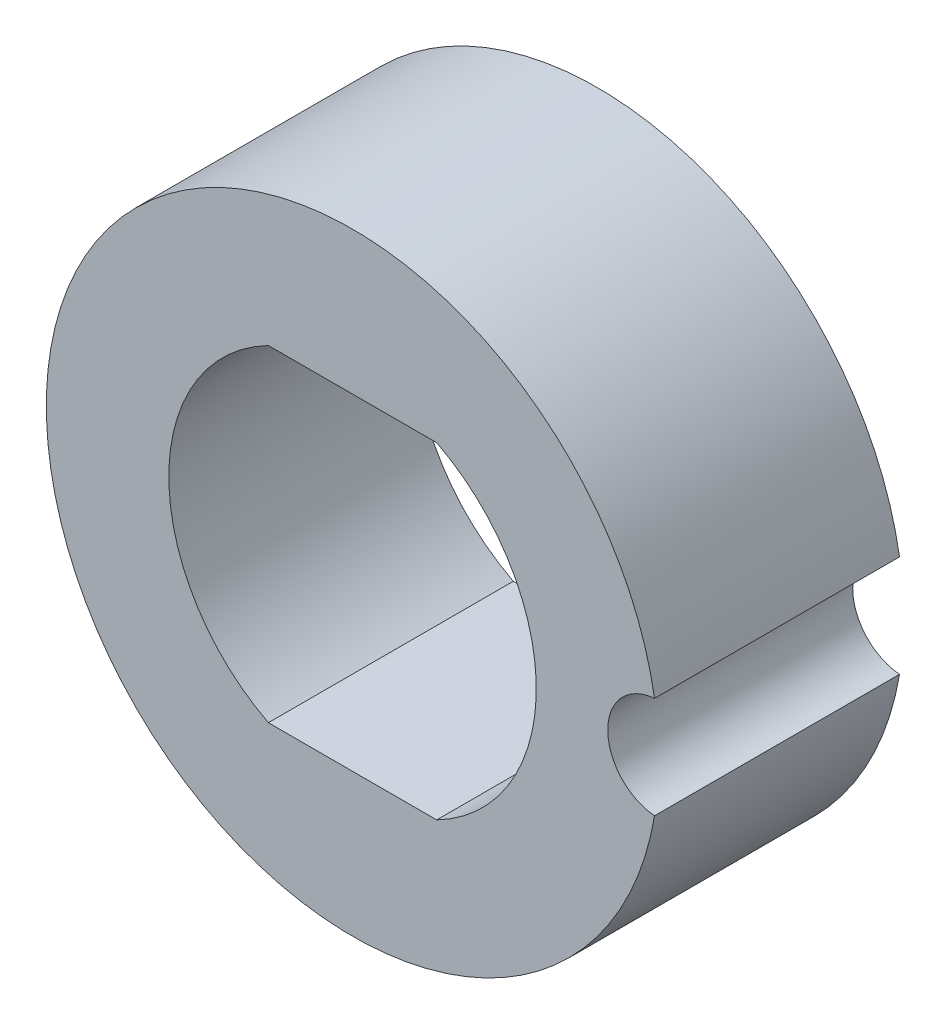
ISO-10303-21;
HEADER;
FILE_DESCRIPTION(('STEP AP214'),'2;1');
FILE_NAME('part.step','',(''),(''),'','','');
FILE_SCHEMA(('AUTOMOTIVE_DESIGN { 1 0 10303 214 1 1 1 1 }'));
ENDSEC;
DATA;
#1=APPLICATION_CONTEXT('core data for automotive mechanical design processes');
#2=APPLICATION_PROTOCOL_DEFINITION('international standard','automotive_design',2000,#1);
#3=PRODUCT_CONTEXT('',#1,'mechanical');
#4=PRODUCT('Part','Part','',(#3));
#5=PRODUCT_RELATED_PRODUCT_CATEGORY('part','',(#4));
#6=PRODUCT_DEFINITION_FORMATION('','',#4);
#7=PRODUCT_DEFINITION_CONTEXT('part definition',#1,'design');
#8=PRODUCT_DEFINITION('design','',#6,#7);
#9=PRODUCT_DEFINITION_SHAPE('','',#8);
#10=(LENGTH_UNIT() NAMED_UNIT(*) SI_UNIT(.MILLI.,.METRE.));
#11=(NAMED_UNIT(*) PLANE_ANGLE_UNIT() SI_UNIT($,.RADIAN.));
#12=(NAMED_UNIT(*) SI_UNIT($,.STERADIAN.) SOLID_ANGLE_UNIT());
#13=UNCERTAINTY_MEASURE_WITH_UNIT(LENGTH_MEASURE(1.E-05),#10,'distance_accuracy_value','');
#14=(GEOMETRIC_REPRESENTATION_CONTEXT(3) GLOBAL_UNCERTAINTY_ASSIGNED_CONTEXT((#13)) GLOBAL_UNIT_ASSIGNED_CONTEXT((#10,
#11,#12)) REPRESENTATION_CONTEXT('',''));
#15=CARTESIAN_POINT('',(0.,0.,0.));
#16=DIRECTION('',(0.,0.,1.));
#17=DIRECTION('',(1.,0.,0.));
#18=AXIS2_PLACEMENT_3D('',#15,#16,#17);
#19=CARTESIAN_POINT('',(7.5,0.,12.));
#20=DIRECTION('',(0.,0.,1.));
#21=DIRECTION('',(1.,0.,0.));
#22=AXIS2_PLACEMENT_3D('',#19,#20,#21);
#23=PLANE('',#22);
#24=CARTESIAN_POINT('',(0.,0.,12.));
#25=DIRECTION('',(0.,0.,1.));
#26=DIRECTION('',(1.,0.,0.));
#27=AXIS2_PLACEMENT_3D('',#24,#25,#26);
#28=CIRCLE('',#27,15.);
#29=CARTESIAN_POINT('',(14.7916666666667,2.49130432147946,12.));
#30=VERTEX_POINT('',#29);
#31=CARTESIAN_POINT('',(14.7916666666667,-2.49130432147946,12.));
#32=VERTEX_POINT('',#31);
#33=EDGE_CURVE('E105',#30,#32,#28,.T.);
#34=ORIENTED_EDGE('',*,*,#33,.T.);
#35=CARTESIAN_POINT('',(15.,0.,12.));
#36=DIRECTION('',(0.,0.,1.));
#37=DIRECTION('',(1.,0.,0.));
#38=AXIS2_PLACEMENT_3D('',#35,#36,#37);
#39=CIRCLE('',#38,2.5);
#40=EDGE_CURVE('E108',#30,#32,#39,.T.);
#41=ORIENTED_EDGE('',*,*,#40,.F.);
#42=EDGE_LOOP('',(#34,#41));
#43=FACE_BOUND('',#42,.T.);
#44=DIRECTION('',(-1.,0.,0.));
#45=VECTOR('',#44,1.);
#46=CARTESIAN_POINT('',(4.12310562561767,-8.,12.));
#47=LINE('',#46,#45);
#48=CARTESIAN_POINT('',(4.12310562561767,-8.,12.));
#49=VERTEX_POINT('',#48);
#50=CARTESIAN_POINT('',(-4.12310562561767,-8.,12.));
#51=VERTEX_POINT('',#50);
#52=EDGE_CURVE('E95',#49,#51,#47,.T.);
#53=ORIENTED_EDGE('',*,*,#52,.T.);
#54=CARTESIAN_POINT('',(0.,0.,12.));
#55=DIRECTION('',(0.,0.,1.));
#56=DIRECTION('',(1.,0.,0.));
#57=AXIS2_PLACEMENT_3D('',#54,#55,#56);
#58=CIRCLE('',#57,9.);
#59=CARTESIAN_POINT('',(-4.12310562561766,8.,12.));
#60=VERTEX_POINT('',#59);
#61=EDGE_CURVE('E68',#60,#51,#58,.T.);
#62=ORIENTED_EDGE('',*,*,#61,.F.);
#63=DIRECTION('',(-1.,0.,0.));
#64=VECTOR('',#63,1.);
#65=CARTESIAN_POINT('',(4.12310562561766,8.,12.));
#66=LINE('',#65,#64);
#67=CARTESIAN_POINT('',(4.12310562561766,8.,12.));
#68=VERTEX_POINT('',#67);
#69=EDGE_CURVE('E90',#68,#60,#66,.T.);
#70=ORIENTED_EDGE('',*,*,#69,.F.);
#71=CARTESIAN_POINT('',(0.,0.,12.));
#72=DIRECTION('',(0.,0.,1.));
#73=DIRECTION('',(1.,0.,0.));
#74=AXIS2_PLACEMENT_3D('',#71,#72,#73);
#75=CIRCLE('',#74,9.);
#76=EDGE_CURVE('E29',#49,#68,#75,.T.);
#77=ORIENTED_EDGE('',*,*,#76,.F.);
#78=EDGE_LOOP('',(#53,#62,#70,#77));
#79=FACE_BOUND('',#78,.T.);
#80=ADVANCED_FACE('F14',(#43,#79),#23,.T.);
#81=CARTESIAN_POINT('',(7.5,0.,0.));
#82=DIRECTION('',(0.,0.,1.));
#83=DIRECTION('',(1.,0.,0.));
#84=AXIS2_PLACEMENT_3D('',#81,#82,#83);
#85=PLANE('',#84);
#86=CARTESIAN_POINT('',(0.,0.,0.));
#87=DIRECTION('',(0.,0.,1.));
#88=DIRECTION('',(1.,0.,0.));
#89=AXIS2_PLACEMENT_3D('',#86,#87,#88);
#90=CIRCLE('',#89,15.);
#91=CARTESIAN_POINT('',(14.7916666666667,2.49130432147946,0.));
#92=VERTEX_POINT('',#91);
#93=CARTESIAN_POINT('',(14.7916666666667,-2.49130432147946,0.));
#94=VERTEX_POINT('',#93);
#95=EDGE_CURVE('E72',#92,#94,#90,.T.);
#96=ORIENTED_EDGE('',*,*,#95,.F.);
#97=CARTESIAN_POINT('',(15.,0.,0.));
#98=DIRECTION('',(0.,0.,1.));
#99=DIRECTION('',(1.,0.,0.));
#100=AXIS2_PLACEMENT_3D('',#97,#98,#99);
#101=CIRCLE('',#100,2.5);
#102=EDGE_CURVE('E102',#92,#94,#101,.T.);
#103=ORIENTED_EDGE('',*,*,#102,.T.);
#104=EDGE_LOOP('',(#96,#103));
#105=FACE_BOUND('',#104,.T.);
#106=CARTESIAN_POINT('',(0.,0.,0.));
#107=DIRECTION('',(0.,0.,1.));
#108=DIRECTION('',(1.,0.,0.));
#109=AXIS2_PLACEMENT_3D('',#106,#107,#108);
#110=CIRCLE('',#109,9.);
#111=CARTESIAN_POINT('',(-4.12310562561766,8.,0.));
#112=VERTEX_POINT('',#111);
#113=CARTESIAN_POINT('',(-4.12310562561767,-8.,0.));
#114=VERTEX_POINT('',#113);
#115=EDGE_CURVE('E37',#112,#114,#110,.T.);
#116=ORIENTED_EDGE('',*,*,#115,.T.);
#117=DIRECTION('',(-1.,0.,0.));
#118=VECTOR('',#117,1.);
#119=CARTESIAN_POINT('',(4.12310562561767,-8.,0.));
#120=LINE('',#119,#118);
#121=CARTESIAN_POINT('',(4.12310562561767,-8.,0.));
#122=VERTEX_POINT('',#121);
#123=EDGE_CURVE('E76',#122,#114,#120,.T.);
#124=ORIENTED_EDGE('',*,*,#123,.F.);
#125=CARTESIAN_POINT('',(0.,0.,0.));
#126=DIRECTION('',(0.,0.,1.));
#127=DIRECTION('',(1.,0.,0.));
#128=AXIS2_PLACEMENT_3D('',#125,#126,#127);
#129=CIRCLE('',#128,9.);
#130=CARTESIAN_POINT('',(4.12310562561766,8.,0.));
#131=VERTEX_POINT('',#130);
#132=EDGE_CURVE('E81',#122,#131,#129,.T.);
#133=ORIENTED_EDGE('',*,*,#132,.T.);
#134=DIRECTION('',(-1.,0.,0.));
#135=VECTOR('',#134,1.);
#136=CARTESIAN_POINT('',(4.12310562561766,8.,0.));
#137=LINE('',#136,#135);
#138=EDGE_CURVE('E86',#131,#112,#137,.T.);
#139=ORIENTED_EDGE('',*,*,#138,.T.);
#140=EDGE_LOOP('',(#116,#124,#133,#139));
#141=FACE_BOUND('',#140,.T.);
#142=ADVANCED_FACE('F84',(#105,#141),#85,.F.);
#143=CARTESIAN_POINT('',(0.,0.,12.));
#144=DIRECTION('',(0.,0.,-1.));
#145=DIRECTION('',(-1.,0.,0.));
#146=AXIS2_PLACEMENT_3D('',#143,#144,#145);
#147=CYLINDRICAL_SURFACE('',#146,15.);
#148=DIRECTION('',(0.,0.,-1.));
#149=VECTOR('',#148,1.);
#150=CARTESIAN_POINT('',(14.7916666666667,-2.49130432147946,12.));
#151=LINE('',#150,#149);
#152=EDGE_CURVE('E9',#32,#94,#151,.T.);
#153=ORIENTED_EDGE('',*,*,#152,.F.);
#154=ORIENTED_EDGE('',*,*,#33,.F.);
#155=DIRECTION('',(0.,0.,-1.));
#156=VECTOR('',#155,1.);
#157=CARTESIAN_POINT('',(14.7916666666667,2.49130432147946,12.));
#158=LINE('',#157,#156);
#159=EDGE_CURVE('E22',#30,#92,#158,.T.);
#160=ORIENTED_EDGE('',*,*,#159,.T.);
#161=ORIENTED_EDGE('',*,*,#95,.T.);
#162=EDGE_LOOP('',(#153,#154,#160,#161));
#163=FACE_BOUND('',#162,.T.);
#164=ADVANCED_FACE('F115',(#163),#147,.T.);
#165=CARTESIAN_POINT('',(15.,0.,12.));
#166=DIRECTION('',(0.,0.,-1.));
#167=DIRECTION('',(-1.,0.,0.));
#168=AXIS2_PLACEMENT_3D('',#165,#166,#167);
#169=CYLINDRICAL_SURFACE('',#168,2.5);
#170=ORIENTED_EDGE('',*,*,#40,.T.);
#171=ORIENTED_EDGE('',*,*,#152,.T.);
#172=ORIENTED_EDGE('',*,*,#102,.F.);
#173=ORIENTED_EDGE('',*,*,#159,.F.);
#174=EDGE_LOOP('',(#170,#171,#172,#173));
#175=FACE_BOUND('',#174,.T.);
#176=ADVANCED_FACE('F16',(#175),#169,.F.);
#177=CARTESIAN_POINT('',(0.,0.,12.));
#178=DIRECTION('',(0.,0.,-1.));
#179=DIRECTION('',(-1.,0.,0.));
#180=AXIS2_PLACEMENT_3D('',#177,#178,#179);
#181=CYLINDRICAL_SURFACE('',#180,9.);
#182=DIRECTION('',(0.,0.,-1.));
#183=VECTOR('',#182,1.);
#184=CARTESIAN_POINT('',(-4.12310562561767,-8.,12.));
#185=LINE('',#184,#183);
#186=EDGE_CURVE('E64',#51,#114,#185,.T.);
#187=ORIENTED_EDGE('',*,*,#186,.T.);
#188=ORIENTED_EDGE('',*,*,#115,.F.);
#189=DIRECTION('',(0.,0.,-1.));
#190=VECTOR('',#189,1.);
#191=CARTESIAN_POINT('',(-4.12310562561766,8.,12.));
#192=LINE('',#191,#190);
#193=EDGE_CURVE('E93',#60,#112,#192,.T.);
#194=ORIENTED_EDGE('',*,*,#193,.F.);
#195=ORIENTED_EDGE('',*,*,#61,.T.);
#196=EDGE_LOOP('',(#187,#188,#194,#195));
#197=FACE_BOUND('',#196,.T.);
#198=ADVANCED_FACE('F66',(#197),#181,.F.);
#199=CARTESIAN_POINT('',(4.12310562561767,-8.,12.));
#200=DIRECTION('',(0.,-1.,0.));
#201=DIRECTION('',(1.,0.,0.));
#202=AXIS2_PLACEMENT_3D('',#199,#200,#201);
#203=PLANE('',#202);
#204=DIRECTION('',(0.,0.,-1.));
#205=VECTOR('',#204,1.);
#206=CARTESIAN_POINT('',(4.12310562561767,-8.,12.));
#207=LINE('',#206,#205);
#208=EDGE_CURVE('E73',#49,#122,#207,.T.);
#209=ORIENTED_EDGE('',*,*,#208,.T.);
#210=ORIENTED_EDGE('',*,*,#123,.T.);
#211=ORIENTED_EDGE('',*,*,#186,.F.);
#212=ORIENTED_EDGE('',*,*,#52,.F.);
#213=EDGE_LOOP('',(#209,#210,#211,#212));
#214=FACE_BOUND('',#213,.T.);
#215=ADVANCED_FACE('F77',(#214),#203,.F.);
#216=CARTESIAN_POINT('',(0.,0.,12.));
#217=DIRECTION('',(0.,0.,-1.));
#218=DIRECTION('',(-1.,0.,0.));
#219=AXIS2_PLACEMENT_3D('',#216,#217,#218);
#220=CYLINDRICAL_SURFACE('',#219,9.);
#221=DIRECTION('',(0.,0.,-1.));
#222=VECTOR('',#221,1.);
#223=CARTESIAN_POINT('',(4.12310562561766,8.,12.));
#224=LINE('',#223,#222);
#225=EDGE_CURVE('E99',#68,#131,#224,.T.);
#226=ORIENTED_EDGE('',*,*,#225,.T.);
#227=ORIENTED_EDGE('',*,*,#132,.F.);
#228=ORIENTED_EDGE('',*,*,#208,.F.);
#229=ORIENTED_EDGE('',*,*,#76,.T.);
#230=EDGE_LOOP('',(#226,#227,#228,#229));
#231=FACE_BOUND('',#230,.T.);
#232=ADVANCED_FACE('F127',(#231),#220,.F.);
#233=CARTESIAN_POINT('',(4.12310562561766,8.,12.));
#234=DIRECTION('',(0.,-1.,0.));
#235=DIRECTION('',(1.,0.,0.));
#236=AXIS2_PLACEMENT_3D('',#233,#234,#235);
#237=PLANE('',#236);
#238=ORIENTED_EDGE('',*,*,#69,.T.);
#239=ORIENTED_EDGE('',*,*,#193,.T.);
#240=ORIENTED_EDGE('',*,*,#138,.F.);
#241=ORIENTED_EDGE('',*,*,#225,.F.);
#242=EDGE_LOOP('',(#238,#239,#240,#241));
#243=FACE_BOUND('',#242,.T.);
#244=ADVANCED_FACE('F126',(#243),#237,.T.);
#245=CLOSED_SHELL('',(#80,#142,#164,#176,#198,#215,#232,#244));
#246=MANIFOLD_SOLID_BREP('B1',#245);
#247=ADVANCED_BREP_SHAPE_REPRESENTATION('',(#18,#246),#14);
#248=SHAPE_DEFINITION_REPRESENTATION(#9,#247);
ENDSEC;
END-ISO-10303-21;
